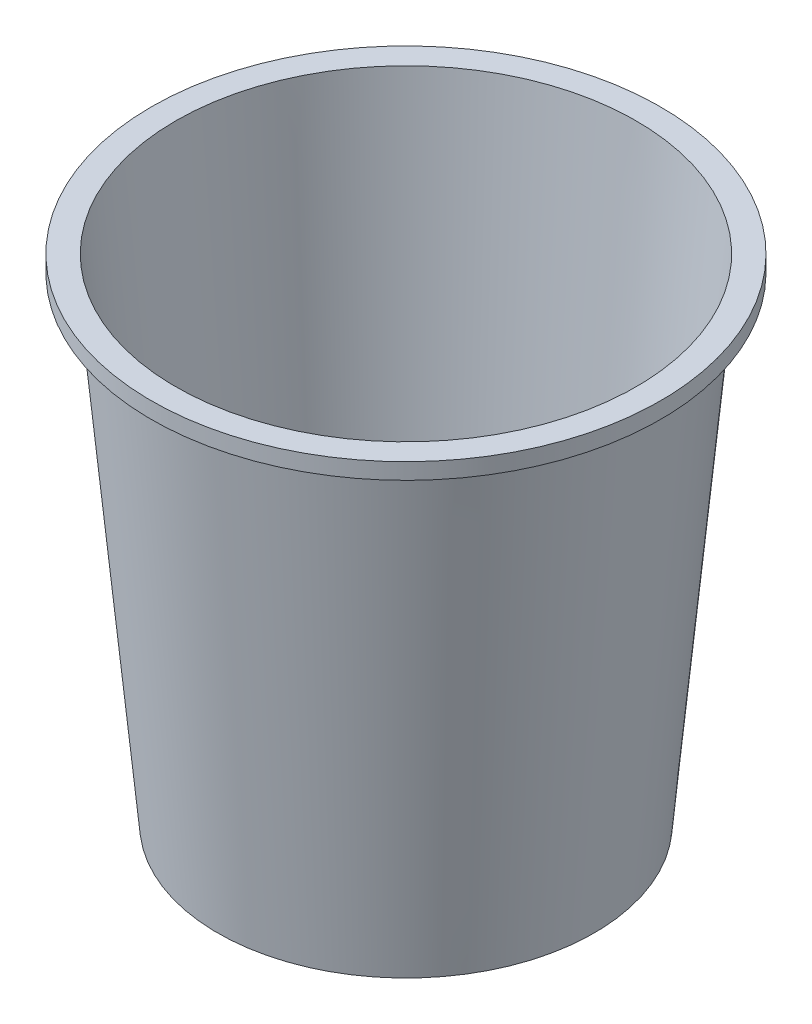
ISO-10303-21;
HEADER;
FILE_DESCRIPTION(('STEP AP214'),'2;1');
FILE_NAME('part.step','',(''),(''),'','','');
FILE_SCHEMA(('AUTOMOTIVE_DESIGN { 1 0 10303 214 1 1 1 1 }'));
ENDSEC;
DATA;
#1=APPLICATION_CONTEXT('core data for automotive mechanical design processes');
#2=APPLICATION_PROTOCOL_DEFINITION('international standard','automotive_design',2000,#1);
#3=PRODUCT_CONTEXT('',#1,'mechanical');
#4=PRODUCT('Part','Part','',(#3));
#5=PRODUCT_RELATED_PRODUCT_CATEGORY('part','',(#4));
#6=PRODUCT_DEFINITION_FORMATION('','',#4);
#7=PRODUCT_DEFINITION_CONTEXT('part definition',#1,'design');
#8=PRODUCT_DEFINITION('design','',#6,#7);
#9=PRODUCT_DEFINITION_SHAPE('','',#8);
#10=(LENGTH_UNIT() NAMED_UNIT(*) SI_UNIT(.MILLI.,.METRE.));
#11=(NAMED_UNIT(*) PLANE_ANGLE_UNIT() SI_UNIT($,.RADIAN.));
#12=(NAMED_UNIT(*) SI_UNIT($,.STERADIAN.) SOLID_ANGLE_UNIT());
#13=UNCERTAINTY_MEASURE_WITH_UNIT(LENGTH_MEASURE(1.E-05),#10,'distance_accuracy_value','');
#14=(GEOMETRIC_REPRESENTATION_CONTEXT(3) GLOBAL_UNCERTAINTY_ASSIGNED_CONTEXT((#13)) GLOBAL_UNIT_ASSIGNED_CONTEXT((#10,
#11,#12)) REPRESENTATION_CONTEXT('',''));
#15=CARTESIAN_POINT('',(0.,0.,0.));
#16=DIRECTION('',(0.,0.,1.));
#17=DIRECTION('',(1.,0.,0.));
#18=AXIS2_PLACEMENT_3D('',#15,#16,#17);
#19=CARTESIAN_POINT('',(23.25,-69.2080471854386,0.));
#20=DIRECTION('',(0.,1.,0.));
#21=DIRECTION('',(-1.,0.,0.));
#22=AXIS2_PLACEMENT_3D('',#19,#20,#21);
#23=PLANE('',#22);
#24=CARTESIAN_POINT('',(0.,-69.2080471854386,0.));
#25=DIRECTION('',(0.,1.,0.));
#26=DIRECTION('',(-1.,0.,0.));
#27=AXIS2_PLACEMENT_3D('',#24,#25,#26);
#28=CIRCLE('',#27,23.25);
#29=CARTESIAN_POINT('',(-23.25,-69.2080471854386,0.));
#30=VERTEX_POINT('',#29);
#31=EDGE_CURVE('E60',#30,#30,#28,.T.);
#32=ORIENTED_EDGE('',*,*,#31,.F.);
#33=EDGE_LOOP('',(#32));
#34=FACE_BOUND('',#33,.T.);
#35=CARTESIAN_POINT('',(0.,-69.2080471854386,0.));
#36=DIRECTION('',(0.,1.,0.));
#37=DIRECTION('',(-1.,0.,0.));
#38=AXIS2_PLACEMENT_3D('',#35,#36,#37);
#39=CIRCLE('',#38,22.2456643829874);
#40=CARTESIAN_POINT('',(-22.2456643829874,-69.2080471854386,0.));
#41=VERTEX_POINT('',#40);
#42=EDGE_CURVE('E10',#41,#41,#39,.T.);
#43=ORIENTED_EDGE('',*,*,#42,.T.);
#44=EDGE_LOOP('',(#43));
#45=FACE_BOUND('',#44,.T.);
#46=ADVANCED_FACE('F32',(#34,#45),#23,.F.);
#47=CARTESIAN_POINT('',(0.,-64.2080471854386,0.));
#48=DIRECTION('',(0.,1.,0.));
#49=DIRECTION('',(-1.,0.,0.));
#50=AXIS2_PLACEMENT_3D('',#47,#48,#49);
#51=CONICAL_SURFACE('',#50,22.7117660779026,0.0929517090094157);
#52=ORIENTED_EDGE('',*,*,#42,.F.);
#53=EDGE_LOOP('',(#52));
#54=FACE_BOUND('',#53,.T.);
#55=CARTESIAN_POINT('',(0.,-64.2080471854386,0.));
#56=DIRECTION('',(0.,1.,0.));
#57=DIRECTION('',(-1.,0.,0.));
#58=AXIS2_PLACEMENT_3D('',#55,#56,#57);
#59=CIRCLE('',#58,22.7117660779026);
#60=CARTESIAN_POINT('',(-22.7117660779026,-64.2080471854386,0.));
#61=VERTEX_POINT('',#60);
#62=EDGE_CURVE('E38',#61,#61,#59,.T.);
#63=ORIENTED_EDGE('',*,*,#62,.T.);
#64=EDGE_LOOP('',(#63));
#65=FACE_BOUND('',#64,.T.);
#66=ADVANCED_FACE('F67',(#54,#65),#51,.F.);
#67=CARTESIAN_POINT('',(0.,-64.2080471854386,0.));
#68=DIRECTION('',(0.,1.,0.));
#69=DIRECTION('',(-1.,0.,0.));
#70=AXIS2_PLACEMENT_3D('',#67,#68,#69);
#71=PLANE('',#70);
#72=ORIENTED_EDGE('',*,*,#62,.F.);
#73=EDGE_LOOP('',(#72));
#74=FACE_BOUND('',#73,.T.);
#75=ADVANCED_FACE('F71',(#74),#71,.F.);
#76=CARTESIAN_POINT('',(0.,-63.7080471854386,0.));
#77=DIRECTION('',(0.,-1.,0.));
#78=DIRECTION('',(1.,0.,0.));
#79=AXIS2_PLACEMENT_3D('',#76,#77,#78);
#80=PLANE('',#79);
#81=CARTESIAN_POINT('',(0.,-63.7080471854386,0.));
#82=DIRECTION('',(0.,1.,0.));
#83=DIRECTION('',(-1.,0.,0.));
#84=AXIS2_PLACEMENT_3D('',#81,#82,#83);
#85=CIRCLE('',#84,23.2605440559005);
#86=CARTESIAN_POINT('',(-23.2605440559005,-63.7080471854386,0.));
#87=VERTEX_POINT('',#86);
#88=EDGE_CURVE('E42',#87,#87,#85,.T.);
#89=ORIENTED_EDGE('',*,*,#88,.T.);
#90=EDGE_LOOP('',(#89));
#91=FACE_BOUND('',#90,.T.);
#92=ADVANCED_FACE('F76',(#91),#80,.F.);
#93=CARTESIAN_POINT('',(0.,-8.20804718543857,0.));
#94=DIRECTION('',(0.,1.,0.));
#95=DIRECTION('',(-1.,0.,0.));
#96=AXIS2_PLACEMENT_3D('',#93,#94,#95);
#97=CONICAL_SURFACE('',#96,28.4342728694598,0.0929517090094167);
#98=ORIENTED_EDGE('',*,*,#88,.F.);
#99=EDGE_LOOP('',(#98));
#100=FACE_BOUND('',#99,.T.);
#101=CARTESIAN_POINT('',(0.,-8.20804718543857,0.));
#102=DIRECTION('',(0.,1.,0.));
#103=DIRECTION('',(-1.,0.,0.));
#104=AXIS2_PLACEMENT_3D('',#101,#102,#103);
#105=CIRCLE('',#104,28.4342728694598);
#106=CARTESIAN_POINT('',(-28.4342728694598,-8.20804718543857,0.));
#107=VERTEX_POINT('',#106);
#108=EDGE_CURVE('E46',#107,#107,#105,.T.);
#109=ORIENTED_EDGE('',*,*,#108,.T.);
#110=EDGE_LOOP('',(#109));
#111=FACE_BOUND('',#110,.T.);
#112=ADVANCED_FACE('F82',(#100,#111),#97,.F.);
#113=CARTESIAN_POINT('',(28.4342728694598,-8.20804718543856,0.));
#114=DIRECTION('',(0.,-1.,0.));
#115=DIRECTION('',(1.,0.,0.));
#116=AXIS2_PLACEMENT_3D('',#113,#114,#115);
#117=PLANE('',#116);
#118=ORIENTED_EDGE('',*,*,#108,.F.);
#119=EDGE_LOOP('',(#118));
#120=FACE_BOUND('',#119,.T.);
#121=CARTESIAN_POINT('',(0.,-8.20804718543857,0.));
#122=DIRECTION('',(0.,1.,0.));
#123=DIRECTION('',(-1.,0.,0.));
#124=AXIS2_PLACEMENT_3D('',#121,#122,#123);
#125=CIRCLE('',#124,31.4342728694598);
#126=CARTESIAN_POINT('',(-31.4342728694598,-8.20804718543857,0.));
#127=VERTEX_POINT('',#126);
#128=EDGE_CURVE('E51',#127,#127,#125,.T.);
#129=ORIENTED_EDGE('',*,*,#128,.T.);
#130=EDGE_LOOP('',(#129));
#131=FACE_BOUND('',#130,.T.);
#132=ADVANCED_FACE('F86',(#120,#131),#117,.F.);
#133=CARTESIAN_POINT('',(0.,0.,0.));
#134=DIRECTION('',(0.,1.,0.));
#135=DIRECTION('',(-1.,0.,0.));
#136=AXIS2_PLACEMENT_3D('',#133,#134,#135);
#137=CYLINDRICAL_SURFACE('',#136,31.4342728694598);
#138=ORIENTED_EDGE('',*,*,#128,.F.);
#139=EDGE_LOOP('',(#138));
#140=FACE_BOUND('',#139,.T.);
#141=CARTESIAN_POINT('',(0.,-10.2080471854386,0.));
#142=DIRECTION('',(0.,1.,0.));
#143=DIRECTION('',(-1.,0.,0.));
#144=AXIS2_PLACEMENT_3D('',#141,#142,#143);
#145=CIRCLE('',#144,31.4342728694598);
#146=CARTESIAN_POINT('',(-31.4342728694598,-10.2080471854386,0.));
#147=VERTEX_POINT('',#146);
#148=EDGE_CURVE('E54',#147,#147,#145,.T.);
#149=ORIENTED_EDGE('',*,*,#148,.T.);
#150=EDGE_LOOP('',(#149));
#151=FACE_BOUND('',#150,.T.);
#152=ADVANCED_FACE('F90',(#140,#151),#137,.T.);
#153=CARTESIAN_POINT('',(28.75,-10.2080471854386,0.));
#154=DIRECTION('',(0.,1.,0.));
#155=DIRECTION('',(-1.,0.,0.));
#156=AXIS2_PLACEMENT_3D('',#153,#154,#155);
#157=PLANE('',#156);
#158=ORIENTED_EDGE('',*,*,#148,.F.);
#159=EDGE_LOOP('',(#158));
#160=FACE_BOUND('',#159,.T.);
#161=CARTESIAN_POINT('',(0.,-10.2080471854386,0.));
#162=DIRECTION('',(0.,1.,0.));
#163=DIRECTION('',(-1.,0.,0.));
#164=AXIS2_PLACEMENT_3D('',#161,#162,#163);
#165=CIRCLE('',#164,28.75);
#166=CARTESIAN_POINT('',(-28.75,-10.2080471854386,0.));
#167=VERTEX_POINT('',#166);
#168=EDGE_CURVE('E57',#167,#167,#165,.T.);
#169=ORIENTED_EDGE('',*,*,#168,.T.);
#170=EDGE_LOOP('',(#169));
#171=FACE_BOUND('',#170,.T.);
#172=ADVANCED_FACE('F94',(#160,#171),#157,.F.);
#173=CARTESIAN_POINT('',(0.,-69.2080471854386,0.));
#174=DIRECTION('',(0.,1.,0.));
#175=DIRECTION('',(-1.,0.,0.));
#176=AXIS2_PLACEMENT_3D('',#173,#174,#175);
#177=CONICAL_SURFACE('',#176,23.25,0.0929517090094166);
#178=ORIENTED_EDGE('',*,*,#168,.F.);
#179=EDGE_LOOP('',(#178));
#180=FACE_BOUND('',#179,.T.);
#181=ORIENTED_EDGE('',*,*,#31,.T.);
#182=EDGE_LOOP('',(#181));
#183=FACE_BOUND('',#182,.T.);
#184=ADVANCED_FACE('F64',(#180,#183),#177,.T.);
#185=CLOSED_SHELL('',(#46,#66,#75,#92,#112,#132,#152,#172,#184));
#186=MANIFOLD_SOLID_BREP('B2',#185);
#187=ADVANCED_BREP_SHAPE_REPRESENTATION('',(#18,#186),#14);
#188=SHAPE_DEFINITION_REPRESENTATION(#9,#187);
ENDSEC;
END-ISO-10303-21;
